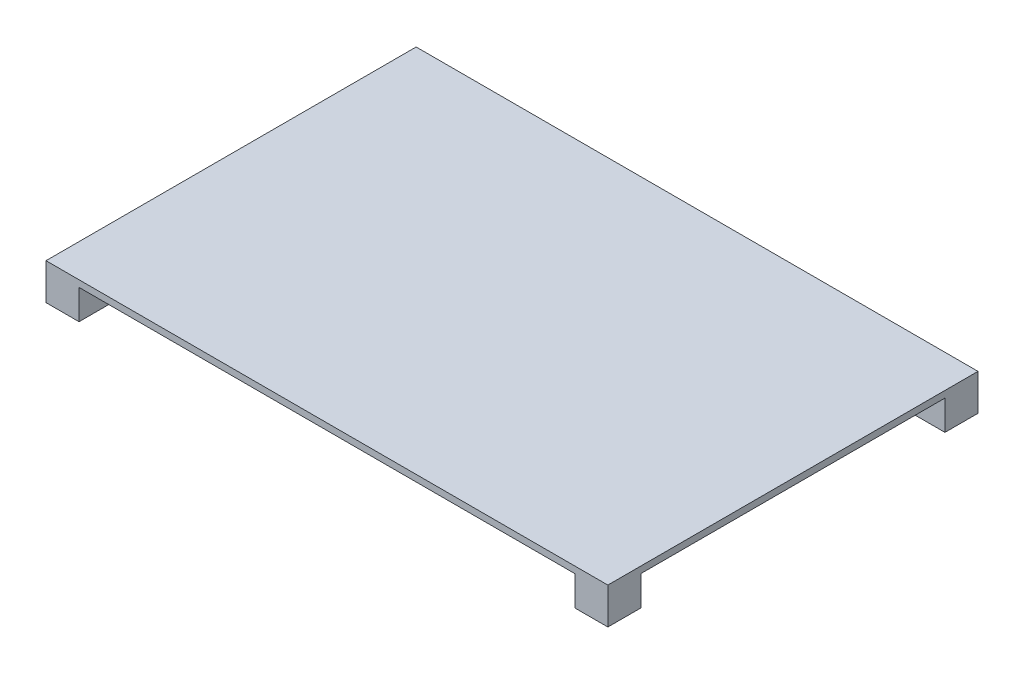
from build123d import *

# Parameters (mm, degrees)
SKETCH1_W           = 85
SKETCH1_H           = 56
BOSS_EXTRUDE1_DEPTH = 1
SKETCH2_W           = 5
SKETCH2_H           = 5
BOSS_EXTRUDE2_DEPTH = 4.5


with BuildPart() as part:
    # Sketch1 → Boss-Extrude1 (new body)
    with BuildSketch(Plane(origin=(0, 0, 0), x_dir=(1, 0, 0), z_dir=(0, 1, 0))):
        Rectangle(SKETCH1_W, SKETCH1_H)
    extrude(amount=BOSS_EXTRUDE1_DEPTH)

    # Sketch2 → Boss-Extrude2 (add)
    with BuildSketch(Plane.XZ):
        with Locations((-40, 25.5)):
            Rectangle(SKETCH2_W, SKETCH2_H)
        with Locations((-40, -25.5)):
            Rectangle(SKETCH2_W, SKETCH2_H)
        with Locations((40, -25.5)):
            Rectangle(SKETCH2_W, SKETCH2_H)
        with Locations((40, 25.5)):
            Rectangle(SKETCH2_W, SKETCH2_H)
    extrude(amount=BOSS_EXTRUDE2_DEPTH)


solid = part.part
